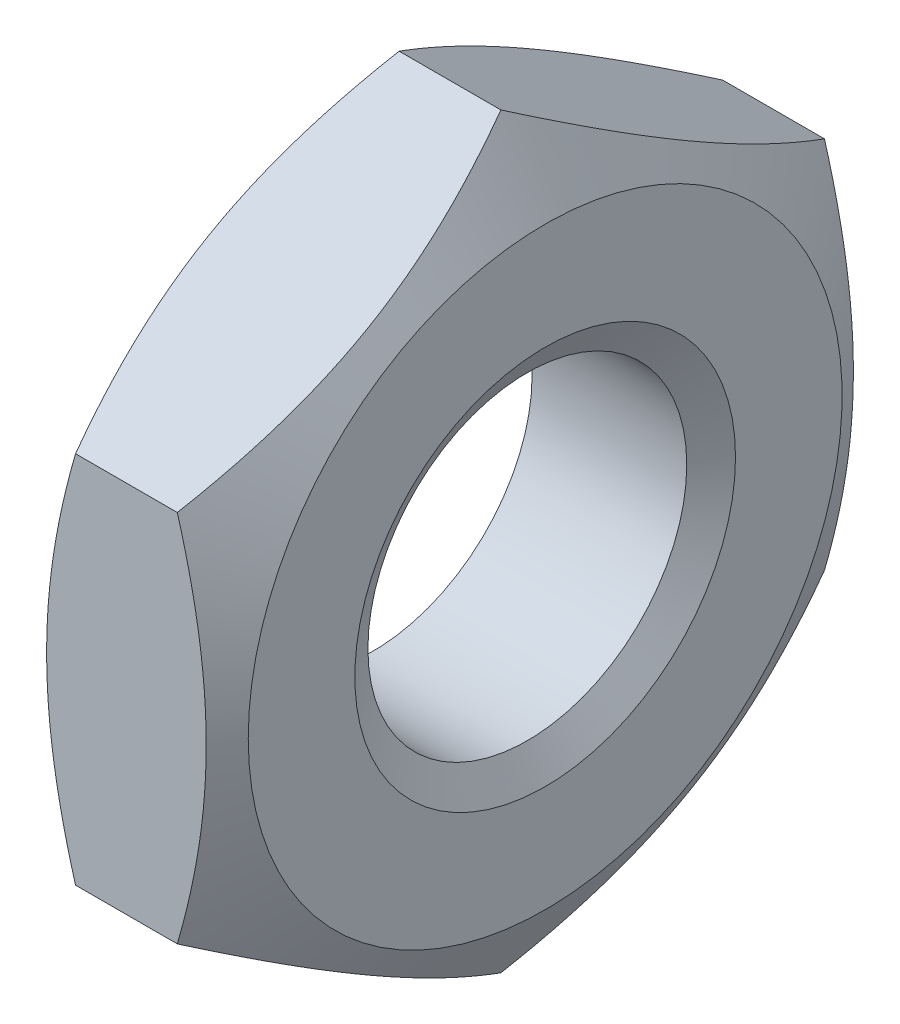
ISO-10303-21;
HEADER;
FILE_DESCRIPTION(('STEP AP214'),'2;1');
FILE_NAME('part.step','',(''),(''),'','','');
FILE_SCHEMA(('AUTOMOTIVE_DESIGN { 1 0 10303 214 1 1 1 1 }'));
ENDSEC;
DATA;
#1=APPLICATION_CONTEXT('core data for automotive mechanical design processes');
#2=APPLICATION_PROTOCOL_DEFINITION('international standard','automotive_design',2000,#1);
#3=PRODUCT_CONTEXT('',#1,'mechanical');
#4=PRODUCT('Part','Part','',(#3));
#5=PRODUCT_RELATED_PRODUCT_CATEGORY('part','',(#4));
#6=PRODUCT_DEFINITION_FORMATION('','',#4);
#7=PRODUCT_DEFINITION_CONTEXT('part definition',#1,'design');
#8=PRODUCT_DEFINITION('design','',#6,#7);
#9=PRODUCT_DEFINITION_SHAPE('','',#8);
#10=(LENGTH_UNIT() NAMED_UNIT(*) SI_UNIT(.MILLI.,.METRE.));
#11=(NAMED_UNIT(*) PLANE_ANGLE_UNIT() SI_UNIT($,.RADIAN.));
#12=(NAMED_UNIT(*) SI_UNIT($,.STERADIAN.) SOLID_ANGLE_UNIT());
#13=UNCERTAINTY_MEASURE_WITH_UNIT(LENGTH_MEASURE(1.E-05),#10,'distance_accuracy_value','');
#14=(GEOMETRIC_REPRESENTATION_CONTEXT(3) GLOBAL_UNCERTAINTY_ASSIGNED_CONTEXT((#13)) GLOBAL_UNIT_ASSIGNED_CONTEXT((#10,
#11,#12)) REPRESENTATION_CONTEXT('',''));
#15=CARTESIAN_POINT('',(0.,0.,0.));
#16=DIRECTION('',(0.,0.,1.));
#17=DIRECTION('',(1.,0.,0.));
#18=AXIS2_PLACEMENT_3D('',#15,#16,#17);
#19=CARTESIAN_POINT('',(0.,0.,0.));
#20=DIRECTION('',(1.,0.,0.));
#21=DIRECTION('',(0.,0.,-1.));
#22=AXIS2_PLACEMENT_3D('',#19,#20,#21);
#23=PLANE('',#22);
#24=CARTESIAN_POINT('',(0.,0.,0.));
#25=DIRECTION('',(-1.,0.,0.));
#26=DIRECTION('',(0.,0.,1.));
#27=AXIS2_PLACEMENT_3D('',#24,#25,#26);
#28=CIRCLE('',#27,4.99989881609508);
#29=CARTESIAN_POINT('',(0.,0.,4.99989881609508));
#30=VERTEX_POINT('',#29);
#31=EDGE_CURVE('E70',#30,#30,#28,.T.);
#32=ORIENTED_EDGE('',*,*,#31,.F.);
#33=EDGE_LOOP('',(#32));
#34=FACE_BOUND('',#33,.T.);
#35=CARTESIAN_POINT('',(0.,0.,0.));
#36=DIRECTION('',(1.,0.,0.));
#37=DIRECTION('',(0.,0.,-1.));
#38=AXIS2_PLACEMENT_3D('',#35,#36,#37);
#39=CIRCLE('',#38,7.8);
#40=CARTESIAN_POINT('',(0.,0.,-7.8));
#41=VERTEX_POINT('',#40);
#42=EDGE_CURVE('E20',#41,#41,#39,.F.);
#43=ORIENTED_EDGE('',*,*,#42,.T.);
#44=EDGE_LOOP('',(#43));
#45=FACE_BOUND('',#44,.T.);
#46=ADVANCED_FACE('F16',(#34,#45),#23,.F.);
#47=CARTESIAN_POINT('',(0.,0.,0.));
#48=DIRECTION('',(1.,0.,0.));
#49=DIRECTION('',(0.,0.,-1.));
#50=AXIS2_PLACEMENT_3D('',#47,#48,#49);
#51=CONICAL_SURFACE('',#50,7.8,1.0471975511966);
#52=CARTESIAN_POINT('',(1.16333456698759,-9.81495457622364,0.));
#53=CARTESIAN_POINT('',(1.10106741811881,-9.70708387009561,-0.186837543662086));
#54=CARTESIAN_POINT('',(1.04162639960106,-9.59881098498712,-0.374371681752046));
#55=CARTESIAN_POINT('',(0.92917498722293,-9.38138590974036,-0.75096295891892));
#56=CARTESIAN_POINT('',(0.876167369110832,-9.27223336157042,-0.94002071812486));
#57=CARTESIAN_POINT('',(0.727835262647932,-8.94302815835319,-1.51022085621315));
#58=CARTESIAN_POINT('',(0.643467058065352,-8.72167601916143,-1.89361400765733));
#59=CARTESIAN_POINT('',(0.544537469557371,-8.39042684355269,-2.46735440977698));
#60=CARTESIAN_POINT('',(0.516355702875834,-8.28151932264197,-2.65598776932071));
#61=CARTESIAN_POINT('',(0.469100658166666,-8.06321182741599,-3.03410744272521));
#62=CARTESIAN_POINT('',(0.450026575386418,-7.95381189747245,-3.2235936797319));
#63=CARTESIAN_POINT('',(0.42147030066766,-7.73482372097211,-3.60289232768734));
#64=CARTESIAN_POINT('',(0.41197722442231,-7.62523583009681,-3.79270412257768));
#65=CARTESIAN_POINT('',(0.402786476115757,-7.40595887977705,-4.17250294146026));
#66=CARTESIAN_POINT('',(0.403088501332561,-7.29626982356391,-4.36248995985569));
#67=CARTESIAN_POINT('',(0.412805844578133,-7.09121002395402,-4.71766395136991));
#68=CARTESIAN_POINT('',(0.421035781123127,-6.9958247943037,-4.88287601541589));
#69=CARTESIAN_POINT('',(0.444742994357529,-6.80527774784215,-5.21291318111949));
#70=CARTESIAN_POINT('',(0.460220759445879,-6.71011594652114,-5.37773825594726));
#71=CARTESIAN_POINT('',(0.517160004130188,-6.42499897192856,-5.87157534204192));
#72=CARTESIAN_POINT('',(0.569120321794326,-6.23554845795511,-6.19971325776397));
#73=CARTESIAN_POINT('',(0.699019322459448,-5.85463808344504,-6.85946937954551));
#74=CARTESIAN_POINT('',(0.777508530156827,-5.66322682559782,-7.19100340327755));
#75=CARTESIAN_POINT('',(0.9556455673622,-5.28325841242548,-7.84912800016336));
#76=CARTESIAN_POINT('',(1.05525156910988,-5.09469639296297,-8.17572699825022));
#77=CARTESIAN_POINT('',(1.16333456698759,-4.9074772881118,-8.50000000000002));
#78=B_SPLINE_CURVE_WITH_KNOTS('',3,(#52,#53,#54,#55,#56,#57,#58,#59,#60,#61,#62,#63,#64,#65,#66,
#67,#68,#69,#70,#71,#72,#73,#74,#75,#76,#77),.UNSPECIFIED.,.F.,.F.,(4,2,2,2,2,2,2,2,2,2,2,2,4),
(0.,0.673588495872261,1.34746659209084,2.69802226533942,3.35676075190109,4.01544102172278,
4.67337216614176,5.33128297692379,5.90398395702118,6.47672353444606,7.62301828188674,
8.79473235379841,9.96414684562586),.UNSPECIFIED.);
#79=CARTESIAN_POINT('',(1.16333456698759,-9.81495457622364,0.));
#80=VERTEX_POINT('',#79);
#81=CARTESIAN_POINT('',(1.16333456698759,-4.90747728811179,-8.50000000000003));
#82=VERTEX_POINT('',#81);
#83=EDGE_CURVE('E69',#80,#82,#78,.T.);
#84=ORIENTED_EDGE('',*,*,#83,.F.);
#85=CARTESIAN_POINT('',(1.16333456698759,-4.90747728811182,8.5));
#86=CARTESIAN_POINT('',(1.10106741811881,-5.01534799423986,8.31316245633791));
#87=CARTESIAN_POINT('',(1.04162639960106,-5.12362087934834,8.12562831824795));
#88=CARTESIAN_POINT('',(0.929174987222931,-5.3410459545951,7.74903704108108));
#89=CARTESIAN_POINT('',(0.876167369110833,-5.45019850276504,7.55997928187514));
#90=CARTESIAN_POINT('',(0.727835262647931,-5.77940370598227,6.98977914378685));
#91=CARTESIAN_POINT('',(0.643467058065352,-6.00075584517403,6.60638599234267));
#92=CARTESIAN_POINT('',(0.544537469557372,-6.33200502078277,6.03264559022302));
#93=CARTESIAN_POINT('',(0.516355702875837,-6.44091254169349,5.84401223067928));
#94=CARTESIAN_POINT('',(0.469100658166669,-6.65922003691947,5.46589255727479));
#95=CARTESIAN_POINT('',(0.450026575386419,-6.76861996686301,5.2764063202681));
#96=CARTESIAN_POINT('',(0.421470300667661,-6.98760814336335,4.89710767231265));
#97=CARTESIAN_POINT('',(0.411977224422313,-7.09719603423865,4.70729587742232));
#98=CARTESIAN_POINT('',(0.402786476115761,-7.31647298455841,4.32749705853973));
#99=CARTESIAN_POINT('',(0.403088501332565,-7.42616204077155,4.13751004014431));
#100=CARTESIAN_POINT('',(0.412805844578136,-7.63122184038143,3.78233604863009));
#101=CARTESIAN_POINT('',(0.42103578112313,-7.72660707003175,3.61712398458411));
#102=CARTESIAN_POINT('',(0.444742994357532,-7.91715411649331,3.28708681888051));
#103=CARTESIAN_POINT('',(0.460220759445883,-8.01231591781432,3.12226174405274));
#104=CARTESIAN_POINT('',(0.517160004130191,-8.29743289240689,2.62842465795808));
#105=CARTESIAN_POINT('',(0.569120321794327,-8.48688340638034,2.30028674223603));
#106=CARTESIAN_POINT('',(0.699019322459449,-8.86779378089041,1.6405306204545));
#107=CARTESIAN_POINT('',(0.777508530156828,-9.05920503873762,1.30899659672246));
#108=CARTESIAN_POINT('',(0.9556455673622,-9.43917345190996,0.650871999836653));
#109=CARTESIAN_POINT('',(1.05525156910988,-9.62773547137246,0.3242730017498));
#110=CARTESIAN_POINT('',(1.16333456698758,-9.81495457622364,0.));
#111=B_SPLINE_CURVE_WITH_KNOTS('',3,(#85,#86,#87,#88,#89,#90,#91,#92,#93,#94,#95,#96,#97,#98,
#99,#100,#101,#102,#103,#104,#105,#106,#107,#108,#109,#110),.UNSPECIFIED.,.F.,.F.,(4,2,2,2,2,2,
2,2,2,2,2,2,4),(0.,0.673588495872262,1.34746659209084,2.69802226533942,3.35676075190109,
4.01544102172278,4.67337216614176,5.33128297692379,5.90398395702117,6.47672353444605,
7.62301828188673,8.79473235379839,9.96414684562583),.UNSPECIFIED.);
#112=CARTESIAN_POINT('',(1.16333456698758,-4.90747728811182,8.5));
#113=VERTEX_POINT('',#112);
#114=EDGE_CURVE('E61',#113,#80,#111,.T.);
#115=ORIENTED_EDGE('',*,*,#114,.F.);
#116=CARTESIAN_POINT('',(1.16333456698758,4.90747728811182,8.5));
#117=CARTESIAN_POINT('',(1.10106741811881,4.69173587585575,8.5));
#118=CARTESIAN_POINT('',(1.04162639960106,4.47519010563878,8.5));
#119=CARTESIAN_POINT('',(0.92917498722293,4.04033995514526,8.5));
#120=CARTESIAN_POINT('',(0.876167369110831,3.82203485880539,8.5));
#121=CARTESIAN_POINT('',(0.727835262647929,3.16362445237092,8.5));
#122=CARTESIAN_POINT('',(0.643467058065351,2.72092017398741,8.5));
#123=CARTESIAN_POINT('',(0.544537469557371,2.05842182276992,8.5));
#124=CARTESIAN_POINT('',(0.516355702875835,1.84060678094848,8.5));
#125=CARTESIAN_POINT('',(0.469100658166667,1.40399179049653,8.5));
#126=CARTESIAN_POINT('',(0.450026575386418,1.18519193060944,8.5));
#127=CARTESIAN_POINT('',(0.42147030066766,0.747215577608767,8.5));
#128=CARTESIAN_POINT('',(0.411977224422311,0.528039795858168,8.5));
#129=CARTESIAN_POINT('',(0.402786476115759,0.0894858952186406,8.5));
#130=CARTESIAN_POINT('',(0.403088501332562,-0.129892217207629,8.5));
#131=CARTESIAN_POINT('',(0.412805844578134,-0.5400118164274,8.5));
#132=CARTESIAN_POINT('',(0.421035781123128,-0.730782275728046,8.5));
#133=CARTESIAN_POINT('',(0.44474299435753,-1.11187636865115,8.5));
#134=CARTESIAN_POINT('',(0.460220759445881,-1.30219997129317,8.5));
#135=CARTESIAN_POINT('',(0.51716000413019,-1.87243392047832,8.5));
#136=CARTESIAN_POINT('',(0.569120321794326,-2.25133494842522,8.5));
#137=CARTESIAN_POINT('',(0.699019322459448,-3.01315569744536,8.5));
#138=CARTESIAN_POINT('',(0.777508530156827,-3.39597821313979,8.5));
#139=CARTESIAN_POINT('',(0.955645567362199,-4.15591503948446,8.5));
#140=CARTESIAN_POINT('',(1.05525156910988,-4.53303907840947,8.5));
#141=CARTESIAN_POINT('',(1.16333456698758,-4.90747728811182,8.5));
#142=B_SPLINE_CURVE_WITH_KNOTS('',3,(#116,#117,#118,#119,#120,#121,#122,#123,#124,#125,#126,
#127,#128,#129,#130,#131,#132,#133,#134,#135,#136,#137,#138,#139,#140,#141),.UNSPECIFIED.,.F.,
.F.,(4,2,2,2,2,2,2,2,2,2,2,2,4),(0.,0.673588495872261,1.34746659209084,2.69802226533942,
3.35676075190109,4.01544102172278,4.67337216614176,5.33128297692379,5.90398395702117,
6.47672353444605,7.62301828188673,8.79473235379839,9.96414684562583),.UNSPECIFIED.);
#143=CARTESIAN_POINT('',(1.16333456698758,4.90747728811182,8.5));
#144=VERTEX_POINT('',#143);
#145=EDGE_CURVE('E66',#144,#113,#142,.T.);
#146=ORIENTED_EDGE('',*,*,#145,.F.);
#147=CARTESIAN_POINT('',(1.16333456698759,9.81495457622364,0.));
#148=CARTESIAN_POINT('',(1.10106741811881,9.70708387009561,0.18683754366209));
#149=CARTESIAN_POINT('',(1.04162639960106,9.59881098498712,0.37437168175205));
#150=CARTESIAN_POINT('',(0.929174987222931,9.38138590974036,0.750962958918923));
#151=CARTESIAN_POINT('',(0.876167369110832,9.27223336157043,0.940020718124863));
#152=CARTESIAN_POINT('',(0.727835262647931,8.94302815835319,1.51022085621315));
#153=CARTESIAN_POINT('',(0.643467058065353,8.72167601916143,1.89361400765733));
#154=CARTESIAN_POINT('',(0.544537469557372,8.39042684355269,2.46735440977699));
#155=CARTESIAN_POINT('',(0.516355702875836,8.28151932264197,2.65598776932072));
#156=CARTESIAN_POINT('',(0.469100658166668,8.06321182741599,3.03410744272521));
#157=CARTESIAN_POINT('',(0.45002657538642,7.95381189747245,3.2235936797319));
#158=CARTESIAN_POINT('',(0.421470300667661,7.73482372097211,3.60289232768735));
#159=CARTESIAN_POINT('',(0.411977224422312,7.62523583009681,3.79270412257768));
#160=CARTESIAN_POINT('',(0.402786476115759,7.40595887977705,4.17250294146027));
#161=CARTESIAN_POINT('',(0.403088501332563,7.29626982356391,4.36248995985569));
#162=CARTESIAN_POINT('',(0.412805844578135,7.09121002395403,4.71766395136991));
#163=CARTESIAN_POINT('',(0.421035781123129,6.9958247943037,4.88287601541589));
#164=CARTESIAN_POINT('',(0.444742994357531,6.80527774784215,5.21291318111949));
#165=CARTESIAN_POINT('',(0.460220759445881,6.71011594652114,5.37773825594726));
#166=CARTESIAN_POINT('',(0.517160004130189,6.42499897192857,5.87157534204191));
#167=CARTESIAN_POINT('',(0.569120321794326,6.23554845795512,6.19971325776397));
#168=CARTESIAN_POINT('',(0.699019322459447,5.85463808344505,6.8594693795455));
#169=CARTESIAN_POINT('',(0.777508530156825,5.66322682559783,7.19100340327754));
#170=CARTESIAN_POINT('',(0.955645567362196,5.2832584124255,7.84912800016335));
#171=CARTESIAN_POINT('',(1.05525156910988,5.09469639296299,8.1757269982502));
#172=CARTESIAN_POINT('',(1.16333456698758,4.90747728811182,8.5));
#173=B_SPLINE_CURVE_WITH_KNOTS('',3,(#147,#148,#149,#150,#151,#152,#153,#154,#155,#156,#157,
#158,#159,#160,#161,#162,#163,#164,#165,#166,#167,#168,#169,#170,#171,#172),.UNSPECIFIED.,.F.,
.F.,(4,2,2,2,2,2,2,2,2,2,2,2,4),(0.,0.67358849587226,1.34746659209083,2.69802226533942,
3.35676075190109,4.01544102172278,4.67337216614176,5.33128297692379,5.90398395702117,
6.47672353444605,7.62301828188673,8.79473235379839,9.96414684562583),.UNSPECIFIED.);
#174=CARTESIAN_POINT('',(1.16333456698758,9.81495457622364,0.));
#175=VERTEX_POINT('',#174);
#176=EDGE_CURVE('E80',#175,#144,#173,.T.);
#177=ORIENTED_EDGE('',*,*,#176,.F.);
#178=CARTESIAN_POINT('',(1.16333456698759,4.90747728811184,-8.5));
#179=CARTESIAN_POINT('',(1.10106741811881,5.01534799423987,-8.31316245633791));
#180=CARTESIAN_POINT('',(1.04162639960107,5.12362087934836,-8.12562831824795));
#181=CARTESIAN_POINT('',(0.929174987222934,5.34104595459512,-7.74903704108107));
#182=CARTESIAN_POINT('',(0.876167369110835,5.45019850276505,-7.55997928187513));
#183=CARTESIAN_POINT('',(0.727835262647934,5.77940370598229,-6.98977914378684));
#184=CARTESIAN_POINT('',(0.643467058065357,6.00075584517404,-6.60638599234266));
#185=CARTESIAN_POINT('',(0.544537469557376,6.33200502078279,-6.03264559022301));
#186=CARTESIAN_POINT('',(0.516355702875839,6.44091254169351,-5.84401223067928));
#187=CARTESIAN_POINT('',(0.469100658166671,6.65922003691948,-5.46589255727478));
#188=CARTESIAN_POINT('',(0.450026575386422,6.76861996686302,-5.27640632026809));
#189=CARTESIAN_POINT('',(0.421470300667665,6.98760814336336,-4.89710767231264));
#190=CARTESIAN_POINT('',(0.411977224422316,7.09719603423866,-4.70729587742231));
#191=CARTESIAN_POINT('',(0.402786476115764,7.31647298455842,-4.32749705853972));
#192=CARTESIAN_POINT('',(0.403088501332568,7.42616204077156,-4.1375100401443));
#193=CARTESIAN_POINT('',(0.41280584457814,7.63122184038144,-3.78233604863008));
#194=CARTESIAN_POINT('',(0.421035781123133,7.72660707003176,-3.6171239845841));
#195=CARTESIAN_POINT('',(0.444742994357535,7.91715411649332,-3.2870868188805));
#196=CARTESIAN_POINT('',(0.460220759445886,8.01231591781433,-3.12226174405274));
#197=CARTESIAN_POINT('',(0.517160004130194,8.2974328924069,-2.62842465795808));
#198=CARTESIAN_POINT('',(0.56912032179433,8.48688340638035,-2.30028674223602));
#199=CARTESIAN_POINT('',(0.699019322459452,8.86779378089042,-1.64053062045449));
#200=CARTESIAN_POINT('',(0.77750853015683,9.05920503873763,-1.30899659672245));
#201=CARTESIAN_POINT('',(0.955645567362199,9.43917345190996,-0.650871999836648));
#202=CARTESIAN_POINT('',(1.05525156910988,9.62773547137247,-0.324273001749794));
#203=CARTESIAN_POINT('',(1.16333456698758,9.81495457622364,0.));
#204=B_SPLINE_CURVE_WITH_KNOTS('',3,(#178,#179,#180,#181,#182,#183,#184,#185,#186,#187,#188,
#189,#190,#191,#192,#193,#194,#195,#196,#197,#198,#199,#200,#201,#202,#203),.UNSPECIFIED.,.F.,
.F.,(4,2,2,2,2,2,2,2,2,2,2,2,4),(0.,0.673588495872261,1.34746659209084,2.69802226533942,
3.35676075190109,4.01544102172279,4.67337216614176,5.3312829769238,5.90398395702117,
6.47672353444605,7.62301828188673,8.79473235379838,9.96414684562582),.UNSPECIFIED.);
#205=CARTESIAN_POINT('',(1.16333456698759,4.90747728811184,-8.5));
#206=VERTEX_POINT('',#205);
#207=EDGE_CURVE('E179',#206,#175,#204,.T.);
#208=ORIENTED_EDGE('',*,*,#207,.F.);
#209=CARTESIAN_POINT('',(1.16333456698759,-4.90747728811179,-8.50000000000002));
#210=CARTESIAN_POINT('',(1.10106741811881,-4.69173587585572,-8.50000000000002));
#211=CARTESIAN_POINT('',(1.04162639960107,-4.47519010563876,-8.50000000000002));
#212=CARTESIAN_POINT('',(0.929174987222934,-4.04033995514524,-8.50000000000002));
#213=CARTESIAN_POINT('',(0.876167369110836,-3.82203485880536,-8.50000000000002));
#214=CARTESIAN_POINT('',(0.727835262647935,-3.16362445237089,-8.50000000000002));
#215=CARTESIAN_POINT('',(0.643467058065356,-2.72092017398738,-8.50000000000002));
#216=CARTESIAN_POINT('',(0.544537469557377,-2.05842182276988,-8.50000000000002));
#217=CARTESIAN_POINT('',(0.516355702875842,-1.84060678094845,-8.50000000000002));
#218=CARTESIAN_POINT('',(0.469100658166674,-1.40399179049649,-8.50000000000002));
#219=CARTESIAN_POINT('',(0.450026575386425,-1.18519193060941,-8.50000000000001));
#220=CARTESIAN_POINT('',(0.421470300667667,-0.747215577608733,-8.50000000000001));
#221=CARTESIAN_POINT('',(0.411977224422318,-0.528039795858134,-8.50000000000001));
#222=CARTESIAN_POINT('',(0.402786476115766,-0.0894858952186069,-8.50000000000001));
#223=CARTESIAN_POINT('',(0.40308850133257,0.129892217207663,-8.50000000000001));
#224=CARTESIAN_POINT('',(0.412805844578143,0.540011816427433,-8.50000000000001));
#225=CARTESIAN_POINT('',(0.421035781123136,0.730782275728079,-8.50000000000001));
#226=CARTESIAN_POINT('',(0.444742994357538,1.11187636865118,-8.50000000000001));
#227=CARTESIAN_POINT('',(0.460220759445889,1.3021999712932,-8.50000000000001));
#228=CARTESIAN_POINT('',(0.517160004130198,1.87243392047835,-8.50000000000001));
#229=CARTESIAN_POINT('',(0.569120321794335,2.25133494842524,-8.50000000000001));
#230=CARTESIAN_POINT('',(0.699019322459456,3.01315569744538,-8.5));
#231=CARTESIAN_POINT('',(0.777508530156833,3.39597821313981,-8.5));
#232=CARTESIAN_POINT('',(0.955645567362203,4.15591503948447,-8.5));
#233=CARTESIAN_POINT('',(1.05525156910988,4.53303907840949,-8.5));
#234=CARTESIAN_POINT('',(1.16333456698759,4.90747728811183,-8.5));
#235=B_SPLINE_CURVE_WITH_KNOTS('',3,(#209,#210,#211,#212,#213,#214,#215,#216,#217,#218,#219,
#220,#221,#222,#223,#224,#225,#226,#227,#228,#229,#230,#231,#232,#233,#234),.UNSPECIFIED.,.F.,
.F.,(4,2,2,2,2,2,2,2,2,2,2,2,4),(0.,0.673588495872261,1.34746659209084,2.69802226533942,
3.35676075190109,4.01544102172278,4.67337216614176,5.3312829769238,5.90398395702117,
6.47672353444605,7.62301828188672,8.79473235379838,9.96414684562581),.UNSPECIFIED.);
#236=EDGE_CURVE('E170',#82,#206,#235,.T.);
#237=ORIENTED_EDGE('',*,*,#236,.F.);
#238=EDGE_LOOP('',(#84,#115,#146,#177,#208,#237));
#239=FACE_BOUND('',#238,.T.);
#240=ORIENTED_EDGE('',*,*,#42,.F.);
#241=EDGE_LOOP('',(#240));
#242=FACE_BOUND('',#241,.T.);
#243=ADVANCED_FACE('F63',(#239,#242),#51,.T.);
#244=CARTESIAN_POINT('',(0.468750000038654,0.,0.));
#245=DIRECTION('',(-1.,0.,0.));
#246=DIRECTION('',(0.,0.,1.));
#247=AXIS2_PLACEMENT_3D('',#244,#245,#246);
#248=CONICAL_SURFACE('',#247,4.18799999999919,1.04719755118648);
#249=ORIENTED_EDGE('',*,*,#31,.T.);
#250=EDGE_LOOP('',(#249));
#251=FACE_BOUND('',#250,.T.);
#252=CARTESIAN_POINT('',(0.46875,0.,0.));
#253=DIRECTION('',(1.,0.,0.));
#254=DIRECTION('',(0.,0.,-1.));
#255=AXIS2_PLACEMENT_3D('',#252,#253,#254);
#256=CIRCLE('',#255,4.188);
#257=CARTESIAN_POINT('',(0.46875,0.,-4.188));
#258=VERTEX_POINT('',#257);
#259=EDGE_CURVE('E214',#258,#258,#256,.T.);
#260=ORIENTED_EDGE('',*,*,#259,.T.);
#261=EDGE_LOOP('',(#260));
#262=FACE_BOUND('',#261,.T.);
#263=ADVANCED_FACE('F176',(#251,#262),#248,.F.);
#264=CARTESIAN_POINT('',(0.,-9.81495457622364,0.));
#265=DIRECTION('',(0.,-0.866025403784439,0.5));
#266=DIRECTION('',(0.,-0.5,-0.866025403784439));
#267=AXIS2_PLACEMENT_3D('',#264,#265,#266);
#268=PLANE('',#267);
#269=CARTESIAN_POINT('',(3.83666543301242,-9.81495457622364,0.));
#270=CARTESIAN_POINT('',(3.89893258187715,-9.70708387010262,0.186837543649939));
#271=CARTESIAN_POINT('',(3.95837360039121,-9.5988109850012,0.374371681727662));
#272=CARTESIAN_POINT('',(4.07082501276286,-9.38138590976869,0.750962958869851));
#273=CARTESIAN_POINT('',(4.12383263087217,-9.27223336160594,0.940020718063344));
#274=CARTESIAN_POINT('',(4.27216473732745,-8.94302815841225,1.51022085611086));
#275=CARTESIAN_POINT('',(4.35653294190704,-8.72167601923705,1.89361400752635));
#276=CARTESIAN_POINT('',(4.45546253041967,-8.3904268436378,2.46735440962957));
#277=CARTESIAN_POINT('',(4.48364429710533,-8.28151932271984,2.65598776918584));
#278=CARTESIAN_POINT('',(4.53089934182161,-8.06321182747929,3.03410744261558));
#279=CARTESIAN_POINT('',(4.54997342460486,-7.95381189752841,3.22359367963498));
#280=CARTESIAN_POINT('',(4.5785296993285,-7.73482372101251,3.60289232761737));
#281=CARTESIAN_POINT('',(4.58802277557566,-7.62523583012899,3.79270412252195));
#282=CARTESIAN_POINT('',(4.59721352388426,-7.40595887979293,4.17250294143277));
#283=CARTESIAN_POINT('',(4.59691149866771,-7.29626982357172,4.36248995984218));
#284=CARTESIAN_POINT('',(4.5871941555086,-7.09121002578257,4.71766394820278));
#285=CARTESIAN_POINT('',(4.57896421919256,-6.99582479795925,4.88287600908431));
#286=CARTESIAN_POINT('',(4.55525700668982,-6.80527775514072,5.212913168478));
#287=CARTESIAN_POINT('',(4.53977924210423,-6.71011595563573,5.37773824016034));
#288=CARTESIAN_POINT('',(4.48283999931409,-6.42499898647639,5.87157531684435));
#289=CARTESIAN_POINT('',(4.43087968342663,-6.23554847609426,6.19971322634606));
#290=CARTESIAN_POINT('',(4.30098068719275,-5.85463810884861,6.85946933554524));
#291=CARTESIAN_POINT('',(4.22249148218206,-5.66322685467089,7.19100335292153));
#292=CARTESIAN_POINT('',(4.04435445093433,-5.28325844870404,7.84912793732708));
#293=CARTESIAN_POINT('',(3.94474845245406,-5.09469643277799,8.1757269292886));
#294=CARTESIAN_POINT('',(3.83666545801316,-4.90747733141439,8.49999992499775));
#295=B_SPLINE_CURVE_WITH_KNOTS('',3,(#269,#270,#271,#272,#273,#274,#275,#276,#277,#278,#279,
#280,#281,#282,#283,#284,#285,#286,#287,#288,#289,#290,#291,#292,#293,#294),.UNSPECIFIED.,.F.,
.F.,(4,2,2,2,2,2,2,2,2,2,2,2,4),(0.,0.673588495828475,1.34746659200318,2.69802226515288,
3.3567607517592,4.01544102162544,4.67337216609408,5.33128297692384,5.90398394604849,
6.47672351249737,7.62301823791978,8.79473228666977,9.9641467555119),.UNSPECIFIED.);
#296=CARTESIAN_POINT('',(3.83666543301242,-9.81495457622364,0.));
#297=VERTEX_POINT('',#296);
#298=CARTESIAN_POINT('',(3.83666544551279,-4.90747730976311,8.49999996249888));
#299=VERTEX_POINT('',#298);
#300=EDGE_CURVE('E76',#297,#299,#295,.T.);
#301=ORIENTED_EDGE('',*,*,#300,.T.);
#302=DIRECTION('',(1.,0.,0.));
#303=VECTOR('',#302,1.);
#304=CARTESIAN_POINT('',(0.,-4.90747728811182,8.5));
#305=LINE('',#304,#303);
#306=EDGE_CURVE('E73',#113,#299,#305,.T.);
#307=ORIENTED_EDGE('',*,*,#306,.F.);
#308=ORIENTED_EDGE('',*,*,#114,.T.);
#309=DIRECTION('',(1.,0.,0.));
#310=VECTOR('',#309,1.);
#311=CARTESIAN_POINT('',(0.,-9.81495457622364,0.));
#312=LINE('',#311,#310);
#313=EDGE_CURVE('E35',#297,#80,#312,.F.);
#314=ORIENTED_EDGE('',*,*,#313,.F.);
#315=EDGE_LOOP('',(#301,#307,#308,#314));
#316=FACE_BOUND('',#315,.T.);
#317=ADVANCED_FACE('F74',(#316),#268,.T.);
#318=CARTESIAN_POINT('',(0.,-4.90747728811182,8.5));
#319=DIRECTION('',(0.,0.,1.));
#320=DIRECTION('',(1.,0.,0.));
#321=AXIS2_PLACEMENT_3D('',#318,#319,#320);
#322=PLANE('',#321);
#323=CARTESIAN_POINT('',(3.83666542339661,-4.90747732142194,8.5));
#324=CARTESIAN_POINT('',(3.89893257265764,-4.69173590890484,8.5));
#325=CARTESIAN_POINT('',(3.95837359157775,-4.4751901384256,8.5));
#326=CARTESIAN_POINT('',(4.07082500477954,-4.04033998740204,8.5));
#327=CARTESIAN_POINT('',(4.12383262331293,-3.8220348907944,8.5));
#328=CARTESIAN_POINT('',(4.27216473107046,-3.16362448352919,8.5));
#329=CARTESIAN_POINT('',(4.35653293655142,-2.72092020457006,8.5));
#330=CARTESIAN_POINT('',(4.45546252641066,-2.05842185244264,8.5));
#331=CARTESIAN_POINT('',(4.48364429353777,-1.84060681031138,8.5));
#332=CARTESIAN_POINT('',(4.53089933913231,-1.40399181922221,8.5));
#333=CARTESIAN_POINT('',(4.54997342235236,-1.18519195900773,8.5));
#334=CARTESIAN_POINT('',(4.5785296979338,-0.747215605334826,8.5));
#335=CARTESIAN_POINT('',(4.5880227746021,-0.528039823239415,8.5));
#336=CARTESIAN_POINT('',(4.59721352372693,-0.0894859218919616,8.5));
#337=CARTESIAN_POINT('',(4.59691149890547,0.129892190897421,8.5));
#338=CARTESIAN_POINT('',(4.58719415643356,0.54001178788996,8.5));
#339=CARTESIAN_POINT('',(4.57896422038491,0.730782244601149,8.5));
#340=CARTESIAN_POINT('',(4.55525700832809,1.11187633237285,8.5));
#341=CARTESIAN_POINT('',(4.539779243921,1.30219993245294,8.5));
#342=CARTESIAN_POINT('',(4.48284000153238,1.87243387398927,8.5));
#343=CARTESIAN_POINT('',(4.4308796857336,2.25133489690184,8.5));
#344=CARTESIAN_POINT('',(4.3009806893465,3.01315563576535,8.5));
#345=CARTESIAN_POINT('',(4.22249148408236,3.39597814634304,8.5));
#346=CARTESIAN_POINT('',(4.04435445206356,4.15591496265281,8.5));
#347=CARTESIAN_POINT('',(3.94474845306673,4.53303899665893,8.5));
#348=CARTESIAN_POINT('',(3.83666545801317,4.90747720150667,8.5));
#349=B_SPLINE_CURVE_WITH_KNOTS('',3,(#323,#324,#325,#326,#327,#328,#329,#330,#331,#332,#333,
#334,#335,#336,#337,#338,#339,#340,#341,#342,#343,#344,#345,#346,#347,#348),.UNSPECIFIED.,.F.,
.F.,(4,2,2,2,2,2,2,2,2,2,2,2,4),(0.,0.673588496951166,1.3474665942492,2.69802226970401,
3.35676075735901,4.01544102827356,4.6733721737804,5.33128298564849,5.90398395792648,
6.4767235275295,7.62301825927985,8.7947323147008,9.96414679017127),.UNSPECIFIED.);
#350=CARTESIAN_POINT('',(3.83666544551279,4.90747724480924,8.5));
#351=VERTEX_POINT('',#350);
#352=EDGE_CURVE('E114',#299,#351,#349,.T.);
#353=ORIENTED_EDGE('',*,*,#352,.T.);
#354=DIRECTION('',(1.,0.,0.));
#355=VECTOR('',#354,1.);
#356=CARTESIAN_POINT('',(0.,4.90747728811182,8.49999999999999));
#357=LINE('',#356,#355);
#358=EDGE_CURVE('E84',#144,#351,#357,.T.);
#359=ORIENTED_EDGE('',*,*,#358,.F.);
#360=ORIENTED_EDGE('',*,*,#145,.T.);
#361=ORIENTED_EDGE('',*,*,#306,.T.);
#362=EDGE_LOOP('',(#353,#359,#360,#361));
#363=FACE_BOUND('',#362,.T.);
#364=ADVANCED_FACE('F82',(#363),#322,.T.);
#365=CARTESIAN_POINT('',(0.,4.90747728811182,8.5));
#366=DIRECTION('',(0.,0.866025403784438,0.500000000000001));
#367=DIRECTION('',(0.,-0.500000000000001,0.866025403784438));
#368=AXIS2_PLACEMENT_3D('',#365,#366,#367);
#369=PLANE('',#368);
#370=CARTESIAN_POINT('',(3.83666542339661,4.90747727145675,8.50000002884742));
#371=CARTESIAN_POINT('',(3.89893257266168,5.01534797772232,8.31316248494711));
#372=CARTESIAN_POINT('',(3.95837359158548,5.123620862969,8.12562834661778));
#373=CARTESIAN_POINT('',(4.07082500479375,5.34104593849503,7.7490370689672));
#374=CARTESIAN_POINT('',(4.12383262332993,5.45019848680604,7.55997930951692));
#375=CARTESIAN_POINT('',(4.27216473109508,5.77940369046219,6.98977917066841));
#376=CARTESIAN_POINT('',(4.35653293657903,6.00075582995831,6.60638601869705));
#377=CARTESIAN_POINT('',(4.45546252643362,6.33200500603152,6.03264561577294));
#378=CARTESIAN_POINT('',(4.48364429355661,6.44091252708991,5.84401225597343));
#379=CARTESIAN_POINT('',(4.53089933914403,6.65922002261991,5.46589258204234));
#380=CARTESIAN_POINT('',(4.54997342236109,6.76861995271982,5.27640634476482));
#381=CARTESIAN_POINT('',(4.57852969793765,6.98760812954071,4.89710769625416));
#382=CARTESIAN_POINT('',(4.58802277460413,7.09719602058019,4.70729590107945));
#383=CARTESIAN_POINT('',(4.59721352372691,7.31647297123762,4.32749708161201));
#384=CARTESIAN_POINT('',(4.5969114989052,7.42616202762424,4.1375100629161));
#385=CARTESIAN_POINT('',(4.58719415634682,7.63122182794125,3.78233607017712));
#386=CARTESIAN_POINT('',(4.57896422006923,7.72660705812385,3.61712400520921));
#387=CARTESIAN_POINT('',(4.55525700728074,7.91715410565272,3.28708683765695));
#388=CARTESIAN_POINT('',(4.53977924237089,8.01231590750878,3.12226176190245));
#389=CARTESIAN_POINT('',(4.48283999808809,8.29743288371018,2.62842467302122));
#390=CARTESIAN_POINT('',(4.43087968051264,8.48688339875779,2.30028675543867));
#391=CARTESIAN_POINT('',(4.30098067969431,8.86779377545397,1.64053062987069));
#392=CARTESIAN_POINT('',(4.22249147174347,9.05920503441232,1.30899660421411));
#393=CARTESIAN_POINT('',(4.04435443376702,9.43917344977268,0.650872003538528));
#394=CARTESIAN_POINT('',(3.94474843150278,9.62773547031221,0.324273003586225));
#395=CARTESIAN_POINT('',(3.83666543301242,9.81495457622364,0.));
#396=B_SPLINE_CURVE_WITH_KNOTS('',3,(#370,#371,#372,#373,#374,#375,#376,#377,#378,#379,#380,
#381,#382,#383,#384,#385,#386,#387,#388,#389,#390,#391,#392,#393,#394,#395),.UNSPECIFIED.,.F.,
.F.,(4,2,2,2,2,2,2,2,2,2,2,2,4),(0.,0.673588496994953,1.34746659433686,2.69802226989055,
3.3567607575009,4.0154410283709,4.67337217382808,5.33128298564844,5.90398396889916,
6.47672354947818,7.62301830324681,8.79473238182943,9.96414688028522),.UNSPECIFIED.);
#397=CARTESIAN_POINT('',(3.83666543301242,9.81495457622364,0.));
#398=VERTEX_POINT('',#397);
#399=EDGE_CURVE('E121',#351,#398,#396,.T.);
#400=ORIENTED_EDGE('',*,*,#399,.T.);
#401=DIRECTION('',(1.,0.,0.));
#402=VECTOR('',#401,1.);
#403=CARTESIAN_POINT('',(0.,9.81495457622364,0.));
#404=LINE('',#403,#402);
#405=EDGE_CURVE('E184',#175,#398,#404,.T.);
#406=ORIENTED_EDGE('',*,*,#405,.F.);
#407=ORIENTED_EDGE('',*,*,#176,.T.);
#408=ORIENTED_EDGE('',*,*,#358,.T.);
#409=EDGE_LOOP('',(#400,#406,#407,#408));
#410=FACE_BOUND('',#409,.T.);
#411=ADVANCED_FACE('F107',(#410),#369,.T.);
#412=CARTESIAN_POINT('',(0.,9.81495457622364,0.));
#413=DIRECTION('',(0.,0.86602540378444,-0.499999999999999));
#414=DIRECTION('',(0.,0.499999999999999,0.86602540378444));
#415=AXIS2_PLACEMENT_3D('',#412,#413,#414);
#416=PLANE('',#415);
#417=CARTESIAN_POINT('',(3.83666543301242,9.81495457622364,0.));
#418=CARTESIAN_POINT('',(3.89893258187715,9.70708387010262,-0.186837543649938));
#419=CARTESIAN_POINT('',(3.95837360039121,9.5988109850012,-0.374371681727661));
#420=CARTESIAN_POINT('',(4.07082501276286,9.38138590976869,-0.750962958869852));
#421=CARTESIAN_POINT('',(4.12383263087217,9.27223336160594,-0.940020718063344));
#422=CARTESIAN_POINT('',(4.27216473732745,8.94302815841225,-1.51022085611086));
#423=CARTESIAN_POINT('',(4.35653294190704,8.72167601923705,-1.89361400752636));
#424=CARTESIAN_POINT('',(4.45546253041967,8.3904268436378,-2.46735440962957));
#425=CARTESIAN_POINT('',(4.48364429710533,8.28151932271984,-2.65598776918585));
#426=CARTESIAN_POINT('',(4.53089934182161,8.06321182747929,-3.03410744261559));
#427=CARTESIAN_POINT('',(4.54997342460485,7.95381189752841,-3.22359367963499));
#428=CARTESIAN_POINT('',(4.57852969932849,7.73482372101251,-3.60289232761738));
#429=CARTESIAN_POINT('',(4.58802277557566,7.62523583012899,-3.79270412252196));
#430=CARTESIAN_POINT('',(4.59721352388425,7.40595887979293,-4.17250294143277));
#431=CARTESIAN_POINT('',(4.5969114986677,7.29626982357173,-4.36248995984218));
#432=CARTESIAN_POINT('',(4.5871941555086,7.09121002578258,-4.71766394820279));
#433=CARTESIAN_POINT('',(4.57896421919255,6.99582479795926,-4.88287600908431));
#434=CARTESIAN_POINT('',(4.55525700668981,6.80527775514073,-5.21291316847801));
#435=CARTESIAN_POINT('',(4.53977924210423,6.71011595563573,-5.37773824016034));
#436=CARTESIAN_POINT('',(4.48283999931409,6.4249989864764,-5.87157531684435));
#437=CARTESIAN_POINT('',(4.43087968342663,6.23554847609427,-6.19971322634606));
#438=CARTESIAN_POINT('',(4.30098068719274,5.85463810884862,-6.85946933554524));
#439=CARTESIAN_POINT('',(4.22249148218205,5.66322685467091,-7.19100335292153));
#440=CARTESIAN_POINT('',(4.04435445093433,5.28325844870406,-7.84912793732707));
#441=CARTESIAN_POINT('',(3.94474845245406,5.09469643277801,-8.1757269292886));
#442=CARTESIAN_POINT('',(3.83666545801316,4.90747733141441,-8.49999992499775));
#443=B_SPLINE_CURVE_WITH_KNOTS('',3,(#417,#418,#419,#420,#421,#422,#423,#424,#425,#426,#427,
#428,#429,#430,#431,#432,#433,#434,#435,#436,#437,#438,#439,#440,#441,#442),.UNSPECIFIED.,.F.,
.F.,(4,2,2,2,2,2,2,2,2,2,2,2,4),(0.,0.673588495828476,1.34746659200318,2.69802226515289,
3.3567607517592,4.01544102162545,4.67337216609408,5.33128297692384,5.90398394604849,
6.47672351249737,7.62301823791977,8.79473228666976,9.96414675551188),.UNSPECIFIED.);
#444=CARTESIAN_POINT('',(3.83666544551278,4.90747730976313,-8.49999996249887));
#445=VERTEX_POINT('',#444);
#446=EDGE_CURVE('E190',#398,#445,#443,.T.);
#447=ORIENTED_EDGE('',*,*,#446,.T.);
#448=DIRECTION('',(1.,0.,0.));
#449=VECTOR('',#448,1.);
#450=CARTESIAN_POINT('',(0.,4.90747728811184,-8.5));
#451=LINE('',#450,#449);
#452=EDGE_CURVE('E169',#206,#445,#451,.T.);
#453=ORIENTED_EDGE('',*,*,#452,.F.);
#454=ORIENTED_EDGE('',*,*,#207,.T.);
#455=ORIENTED_EDGE('',*,*,#405,.T.);
#456=EDGE_LOOP('',(#447,#453,#454,#455));
#457=FACE_BOUND('',#456,.T.);
#458=ADVANCED_FACE('F185',(#457),#416,.T.);
#459=CARTESIAN_POINT('',(0.,4.90747728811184,-8.5));
#460=DIRECTION('',(0.,0.,-1.));
#461=DIRECTION('',(0.,1.,0.));
#462=AXIS2_PLACEMENT_3D('',#459,#460,#461);
#463=PLANE('',#462);
#464=CARTESIAN_POINT('',(3.83666542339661,4.90747732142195,-8.5));
#465=CARTESIAN_POINT('',(3.89893257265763,4.69173590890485,-8.5));
#466=CARTESIAN_POINT('',(3.95837359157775,4.47519013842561,-8.5));
#467=CARTESIAN_POINT('',(4.07082500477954,4.04033998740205,-8.5));
#468=CARTESIAN_POINT('',(4.12383262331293,3.82203489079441,-8.5));
#469=CARTESIAN_POINT('',(4.27216473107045,3.1636244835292,-8.50000000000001));
#470=CARTESIAN_POINT('',(4.35653293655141,2.72092020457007,-8.50000000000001));
#471=CARTESIAN_POINT('',(4.45546252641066,2.05842185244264,-8.50000000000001));
#472=CARTESIAN_POINT('',(4.48364429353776,1.84060681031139,-8.50000000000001));
#473=CARTESIAN_POINT('',(4.5308993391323,1.40399181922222,-8.50000000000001));
#474=CARTESIAN_POINT('',(4.54997342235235,1.18519195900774,-8.50000000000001));
#475=CARTESIAN_POINT('',(4.5785296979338,0.747215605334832,-8.50000000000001));
#476=CARTESIAN_POINT('',(4.5880227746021,0.528039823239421,-8.50000000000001));
#477=CARTESIAN_POINT('',(4.59721352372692,0.0894859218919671,-8.50000000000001));
#478=CARTESIAN_POINT('',(4.59691149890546,-0.129892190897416,-8.50000000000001));
#479=CARTESIAN_POINT('',(4.58719415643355,-0.540011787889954,-8.50000000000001));
#480=CARTESIAN_POINT('',(4.5789642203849,-0.730782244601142,-8.50000000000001));
#481=CARTESIAN_POINT('',(4.55525700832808,-1.11187633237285,-8.50000000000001));
#482=CARTESIAN_POINT('',(4.539779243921,-1.30219993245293,-8.50000000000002));
#483=CARTESIAN_POINT('',(4.48284000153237,-1.87243387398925,-8.50000000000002));
#484=CARTESIAN_POINT('',(4.43087968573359,-2.25133489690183,-8.50000000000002));
#485=CARTESIAN_POINT('',(4.3009806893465,-3.01315563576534,-8.50000000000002));
#486=CARTESIAN_POINT('',(4.22249148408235,-3.39597814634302,-8.50000000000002));
#487=CARTESIAN_POINT('',(4.04435445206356,-4.15591496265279,-8.50000000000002));
#488=CARTESIAN_POINT('',(3.94474845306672,-4.53303899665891,-8.50000000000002));
#489=CARTESIAN_POINT('',(3.83666545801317,-4.90747720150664,-8.50000000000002));
#490=B_SPLINE_CURVE_WITH_KNOTS('',3,(#464,#465,#466,#467,#468,#469,#470,#471,#472,#473,#474,
#475,#476,#477,#478,#479,#480,#481,#482,#483,#484,#485,#486,#487,#488,#489),.UNSPECIFIED.,.F.,
.F.,(4,2,2,2,2,2,2,2,2,2,2,2,4),(0.,0.673588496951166,1.3474665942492,2.69802226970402,
3.35676075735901,4.01544102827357,4.6733721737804,5.33128298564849,5.90398395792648,
6.4767235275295,7.62301825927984,8.79473231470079,9.96414679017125),.UNSPECIFIED.);
#491=CARTESIAN_POINT('',(3.83666544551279,-4.90747724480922,-8.50000000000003));
#492=VERTEX_POINT('',#491);
#493=EDGE_CURVE('E145',#445,#492,#490,.T.);
#494=ORIENTED_EDGE('',*,*,#493,.T.);
#495=DIRECTION('',(1.,0.,0.));
#496=VECTOR('',#495,1.);
#497=CARTESIAN_POINT('',(0.,-4.90747728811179,-8.50000000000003));
#498=LINE('',#497,#496);
#499=EDGE_CURVE('E168',#82,#492,#498,.T.);
#500=ORIENTED_EDGE('',*,*,#499,.F.);
#501=ORIENTED_EDGE('',*,*,#236,.T.);
#502=ORIENTED_EDGE('',*,*,#452,.T.);
#503=EDGE_LOOP('',(#494,#500,#501,#502));
#504=FACE_BOUND('',#503,.T.);
#505=ADVANCED_FACE('F160',(#504),#463,.T.);
#506=CARTESIAN_POINT('',(0.,-4.9074772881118,-8.50000000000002));
#507=DIRECTION('',(0.,-0.866025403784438,-0.500000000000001));
#508=DIRECTION('',(0.,0.500000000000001,-0.866025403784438));
#509=AXIS2_PLACEMENT_3D('',#506,#507,#508);
#510=PLANE('',#509);
#511=CARTESIAN_POINT('',(3.83666542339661,-4.90747727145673,-8.50000002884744));
#512=CARTESIAN_POINT('',(3.89893257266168,-5.0153479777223,-8.31316248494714));
#513=CARTESIAN_POINT('',(3.95837359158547,-5.12362086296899,-8.12562834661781));
#514=CARTESIAN_POINT('',(4.07082500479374,-5.34104593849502,-7.74903706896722));
#515=CARTESIAN_POINT('',(4.12383262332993,-5.45019848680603,-7.55997930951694));
#516=CARTESIAN_POINT('',(4.27216473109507,-5.77940369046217,-6.98977917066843));
#517=CARTESIAN_POINT('',(4.35653293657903,-6.0007558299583,-6.60638601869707));
#518=CARTESIAN_POINT('',(4.45546252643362,-6.3320050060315,-6.03264561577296));
#519=CARTESIAN_POINT('',(4.48364429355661,-6.44091252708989,-5.84401225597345));
#520=CARTESIAN_POINT('',(4.53089933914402,-6.6592200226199,-5.46589258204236));
#521=CARTESIAN_POINT('',(4.54997342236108,-6.7686199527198,-5.27640634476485));
#522=CARTESIAN_POINT('',(4.57852969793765,-6.98760812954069,-4.89710769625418));
#523=CARTESIAN_POINT('',(4.58802277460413,-7.09719602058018,-4.70729590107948));
#524=CARTESIAN_POINT('',(4.59721352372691,-7.31647297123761,-4.32749708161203));
#525=CARTESIAN_POINT('',(4.5969114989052,-7.42616202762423,-4.13751006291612));
#526=CARTESIAN_POINT('',(4.58719415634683,-7.63122182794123,-3.78233607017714));
#527=CARTESIAN_POINT('',(4.57896422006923,-7.72660705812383,-3.61712400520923));
#528=CARTESIAN_POINT('',(4.55525700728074,-7.91715410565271,-3.28708683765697));
#529=CARTESIAN_POINT('',(4.53977924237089,-8.01231590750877,-3.12226176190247));
#530=CARTESIAN_POINT('',(4.48283999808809,-8.29743288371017,-2.62842467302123));
#531=CARTESIAN_POINT('',(4.43087968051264,-8.48688339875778,-2.30028675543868));
#532=CARTESIAN_POINT('',(4.30098067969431,-8.86779377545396,-1.6405306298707));
#533=CARTESIAN_POINT('',(4.22249147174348,-9.05920503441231,-1.30899660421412));
#534=CARTESIAN_POINT('',(4.04435443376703,-9.43917344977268,-0.650872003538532));
#535=CARTESIAN_POINT('',(3.94474843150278,-9.6277354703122,-0.324273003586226));
#536=CARTESIAN_POINT('',(3.83666543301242,-9.81495457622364,0.));
#537=B_SPLINE_CURVE_WITH_KNOTS('',3,(#511,#512,#513,#514,#515,#516,#517,#518,#519,#520,#521,
#522,#523,#524,#525,#526,#527,#528,#529,#530,#531,#532,#533,#534,#535,#536),.UNSPECIFIED.,.F.,
.F.,(4,2,2,2,2,2,2,2,2,2,2,2,4),(0.,0.673588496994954,1.34746659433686,2.69802226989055,
3.3567607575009,4.01544102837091,4.67337217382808,5.33128298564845,5.90398396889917,
6.47672354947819,7.62301830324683,8.79473238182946,9.96414688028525),.UNSPECIFIED.);
#538=EDGE_CURVE('E151',#492,#297,#537,.T.);
#539=ORIENTED_EDGE('',*,*,#538,.T.);
#540=ORIENTED_EDGE('',*,*,#313,.T.);
#541=ORIENTED_EDGE('',*,*,#83,.T.);
#542=ORIENTED_EDGE('',*,*,#499,.T.);
#543=EDGE_LOOP('',(#539,#540,#541,#542));
#544=FACE_BOUND('',#543,.T.);
#545=ADVANCED_FACE('F157',(#544),#510,.T.);
#546=CARTESIAN_POINT('',(-21.5453702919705,0.,0.));
#547=DIRECTION('',(1.,0.,0.));
#548=DIRECTION('',(0.,0.,-1.));
#549=AXIS2_PLACEMENT_3D('',#546,#547,#548);
#550=CYLINDRICAL_SURFACE('',#549,4.188);
#551=ORIENTED_EDGE('',*,*,#259,.F.);
#552=EDGE_LOOP('',(#551));
#553=FACE_BOUND('',#552,.T.);
#554=CARTESIAN_POINT('',(4.5312499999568,0.,0.));
#555=DIRECTION('',(1.,0.,0.));
#556=DIRECTION('',(0.,0.,1.));
#557=AXIS2_PLACEMENT_3D('',#554,#555,#556);
#558=CIRCLE('',#557,4.18799999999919);
#559=CARTESIAN_POINT('',(4.5312499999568,0.,4.18799999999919));
#560=VERTEX_POINT('',#559);
#561=EDGE_CURVE('E156',#560,#560,#558,.F.);
#562=ORIENTED_EDGE('',*,*,#561,.F.);
#563=EDGE_LOOP('',(#562));
#564=FACE_BOUND('',#563,.T.);
#565=ADVANCED_FACE('F133',(#553,#564),#550,.F.);
#566=CARTESIAN_POINT('',(5.,0.,0.));
#567=DIRECTION('',(-1.,0.,0.));
#568=DIRECTION('',(0.,0.,1.));
#569=AXIS2_PLACEMENT_3D('',#566,#567,#568);
#570=CONICAL_SURFACE('',#569,7.8,1.0471975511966);
#571=CARTESIAN_POINT('',(5.,0.,0.));
#572=DIRECTION('',(-1.,0.,0.));
#573=DIRECTION('',(0.,0.,1.));
#574=AXIS2_PLACEMENT_3D('',#571,#572,#573);
#575=CIRCLE('',#574,7.8);
#576=CARTESIAN_POINT('',(5.,0.,7.8));
#577=VERTEX_POINT('',#576);
#578=EDGE_CURVE('E26',#577,#577,#575,.F.);
#579=ORIENTED_EDGE('',*,*,#578,.F.);
#580=EDGE_LOOP('',(#579));
#581=FACE_BOUND('',#580,.T.);
#582=ORIENTED_EDGE('',*,*,#300,.F.);
#583=ORIENTED_EDGE('',*,*,#538,.F.);
#584=ORIENTED_EDGE('',*,*,#493,.F.);
#585=ORIENTED_EDGE('',*,*,#446,.F.);
#586=ORIENTED_EDGE('',*,*,#399,.F.);
#587=ORIENTED_EDGE('',*,*,#352,.F.);
#588=EDGE_LOOP('',(#582,#583,#584,#585,#586,#587));
#589=FACE_BOUND('',#588,.T.);
#590=ADVANCED_FACE('F135',(#581,#589),#570,.T.);
#591=CARTESIAN_POINT('',(4.5312499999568,0.,0.));
#592=DIRECTION('',(1.,0.,0.));
#593=DIRECTION('',(0.,0.,-1.));
#594=AXIS2_PLACEMENT_3D('',#591,#592,#593);
#595=CONICAL_SURFACE('',#594,4.18799999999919,1.04719755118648);
#596=CARTESIAN_POINT('',(4.99999999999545,0.,0.));
#597=DIRECTION('',(1.,0.,0.));
#598=DIRECTION('',(0.,0.,-1.));
#599=AXIS2_PLACEMENT_3D('',#596,#597,#598);
#600=CIRCLE('',#599,4.99989881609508);
#601=CARTESIAN_POINT('',(4.99999999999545,0.,-4.99989881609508));
#602=VERTEX_POINT('',#601);
#603=EDGE_CURVE('E10',#602,#602,#600,.F.);
#604=ORIENTED_EDGE('',*,*,#603,.F.);
#605=EDGE_LOOP('',(#604));
#606=FACE_BOUND('',#605,.T.);
#607=ORIENTED_EDGE('',*,*,#561,.T.);
#608=EDGE_LOOP('',(#607));
#609=FACE_BOUND('',#608,.T.);
#610=ADVANCED_FACE('F140',(#606,#609),#595,.F.);
#611=CARTESIAN_POINT('',(5.,0.,0.));
#612=DIRECTION('',(1.,0.,0.));
#613=DIRECTION('',(0.,0.,-1.));
#614=AXIS2_PLACEMENT_3D('',#611,#612,#613);
#615=PLANE('',#614);
#616=ORIENTED_EDGE('',*,*,#603,.T.);
#617=EDGE_LOOP('',(#616));
#618=FACE_BOUND('',#617,.T.);
#619=ORIENTED_EDGE('',*,*,#578,.T.);
#620=EDGE_LOOP('',(#619));
#621=FACE_BOUND('',#620,.T.);
#622=ADVANCED_FACE('F18',(#618,#621),#615,.T.);
#623=CLOSED_SHELL('',(#46,#243,#263,#317,#364,#411,#458,#505,#545,#565,#590,#610,#622));
#624=MANIFOLD_SOLID_BREP('B1',#623);
#625=ADVANCED_BREP_SHAPE_REPRESENTATION('',(#18,#624),#14);
#626=SHAPE_DEFINITION_REPRESENTATION(#9,#625);
ENDSEC;
END-ISO-10303-21;
